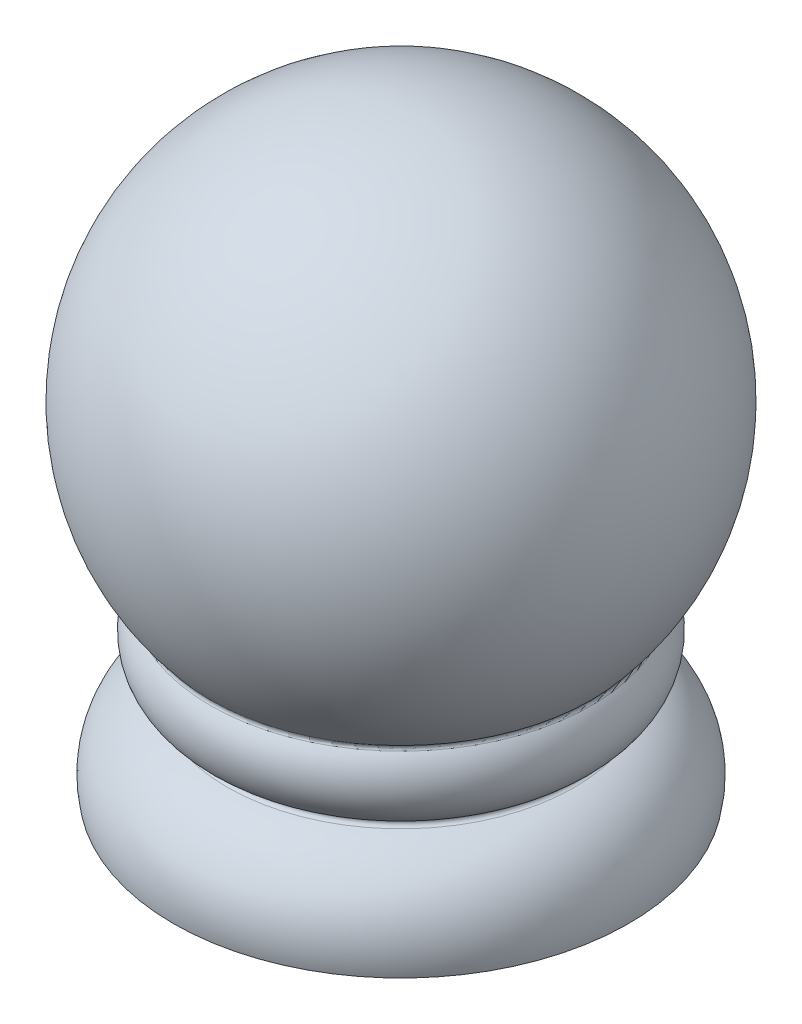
ISO-10303-21;
HEADER;
FILE_DESCRIPTION(('STEP AP214'),'2;1');
FILE_NAME('part.step','',(''),(''),'','','');
FILE_SCHEMA(('AUTOMOTIVE_DESIGN { 1 0 10303 214 1 1 1 1 }'));
ENDSEC;
DATA;
#1=APPLICATION_CONTEXT('core data for automotive mechanical design processes');
#2=APPLICATION_PROTOCOL_DEFINITION('international standard','automotive_design',2000,#1);
#3=PRODUCT_CONTEXT('',#1,'mechanical');
#4=PRODUCT('Part','Part','',(#3));
#5=PRODUCT_RELATED_PRODUCT_CATEGORY('part','',(#4));
#6=PRODUCT_DEFINITION_FORMATION('','',#4);
#7=PRODUCT_DEFINITION_CONTEXT('part definition',#1,'design');
#8=PRODUCT_DEFINITION('design','',#6,#7);
#9=PRODUCT_DEFINITION_SHAPE('','',#8);
#10=(LENGTH_UNIT() NAMED_UNIT(*) SI_UNIT(.MILLI.,.METRE.));
#11=(NAMED_UNIT(*) PLANE_ANGLE_UNIT() SI_UNIT($,.RADIAN.));
#12=(NAMED_UNIT(*) SI_UNIT($,.STERADIAN.) SOLID_ANGLE_UNIT());
#13=UNCERTAINTY_MEASURE_WITH_UNIT(LENGTH_MEASURE(1.E-05),#10,'distance_accuracy_value','');
#14=(GEOMETRIC_REPRESENTATION_CONTEXT(3) GLOBAL_UNCERTAINTY_ASSIGNED_CONTEXT((#13)) GLOBAL_UNIT_ASSIGNED_CONTEXT((#10,
#11,#12)) REPRESENTATION_CONTEXT('',''));
#15=CARTESIAN_POINT('',(0.,0.,0.));
#16=DIRECTION('',(0.,0.,1.));
#17=DIRECTION('',(1.,0.,0.));
#18=AXIS2_PLACEMENT_3D('',#15,#16,#17);
#19=CARTESIAN_POINT('',(10.,30.,0.));
#20=DIRECTION('',(0.,-1.,0.));
#21=DIRECTION('',(0.,0.,-1.));
#22=AXIS2_PLACEMENT_3D('',#19,#20,#21);
#23=PLANE('',#22);
#24=CARTESIAN_POINT('',(0.,30.,0.));
#25=DIRECTION('',(0.,-1.,0.));
#26=DIRECTION('',(0.,0.,-1.));
#27=AXIS2_PLACEMENT_3D('',#24,#25,#26);
#28=CIRCLE('',#27,8.);
#29=CARTESIAN_POINT('',(0.,30.,-8.));
#30=VERTEX_POINT('',#29);
#31=EDGE_CURVE('E10',#30,#30,#28,.T.);
#32=ORIENTED_EDGE('',*,*,#31,.T.);
#33=EDGE_LOOP('',(#32));
#34=FACE_BOUND('',#33,.T.);
#35=CARTESIAN_POINT('',(0.,30.,0.));
#36=DIRECTION('',(0.,-1.,0.));
#37=DIRECTION('',(0.,0.,-1.));
#38=AXIS2_PLACEMENT_3D('',#35,#36,#37);
#39=CIRCLE('',#38,4.5);
#40=CARTESIAN_POINT('',(0.,30.,-4.5));
#41=VERTEX_POINT('',#40);
#42=EDGE_CURVE('E80',#41,#41,#39,.T.);
#43=ORIENTED_EDGE('',*,*,#42,.F.);
#44=EDGE_LOOP('',(#43));
#45=FACE_BOUND('',#44,.T.);
#46=ADVANCED_FACE('F30',(#34,#45),#23,.T.);
#47=CARTESIAN_POINT('',(0.,0.,0.));
#48=DIRECTION('',(0.,1.,0.));
#49=DIRECTION('',(0.,0.,1.));
#50=AXIS2_PLACEMENT_3D('',#47,#48,#49);
#51=PLANE('',#50);
#52=CARTESIAN_POINT('',(0.,0.,0.));
#53=DIRECTION('',(0.,1.,0.));
#54=DIRECTION('',(0.,0.,1.));
#55=AXIS2_PLACEMENT_3D('',#52,#53,#54);
#56=CIRCLE('',#55,14.5);
#57=CARTESIAN_POINT('',(0.,0.,14.5));
#58=VERTEX_POINT('',#57);
#59=EDGE_CURVE('E56',#58,#58,#56,.T.);
#60=ORIENTED_EDGE('',*,*,#59,.F.);
#61=EDGE_LOOP('',(#60));
#62=FACE_BOUND('',#61,.T.);
#63=CARTESIAN_POINT('',(0.,0.,0.));
#64=DIRECTION('',(0.,1.,0.));
#65=DIRECTION('',(0.,0.,1.));
#66=AXIS2_PLACEMENT_3D('',#63,#64,#65);
#67=CIRCLE('',#66,13.5);
#68=CARTESIAN_POINT('',(0.,0.,13.5));
#69=VERTEX_POINT('',#68);
#70=EDGE_CURVE('E57',#69,#69,#67,.F.);
#71=ORIENTED_EDGE('',*,*,#70,.F.);
#72=EDGE_LOOP('',(#71));
#73=FACE_BOUND('',#72,.T.);
#74=ADVANCED_FACE('F32',(#62,#73),#51,.F.);
#75=CARTESIAN_POINT('',(0.,1.01568651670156,0.));
#76=DIRECTION('',(0.,1.,0.));
#77=DIRECTION('',(0.,0.,1.));
#78=AXIS2_PLACEMENT_3D('',#75,#76,#77);
#79=TOROIDAL_SURFACE('',#78,9.60424868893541,5.);
#80=CARTESIAN_POINT('',(0.,5.79974780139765,0.));
#81=DIRECTION('',(0.,1.,0.));
#82=DIRECTION('',(0.,0.,1.));
#83=AXIS2_PLACEMENT_3D('',#80,#81,#82);
#84=CIRCLE('',#83,11.0577814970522);
#85=CARTESIAN_POINT('',(0.,5.79974780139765,11.0577814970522));
#86=VERTEX_POINT('',#85);
#87=EDGE_CURVE('E64',#86,#86,#84,.T.);
#88=ORIENTED_EDGE('',*,*,#87,.F.);
#89=EDGE_LOOP('',(#88));
#90=FACE_BOUND('',#89,.T.);
#91=ORIENTED_EDGE('',*,*,#59,.T.);
#92=EDGE_LOOP('',(#91));
#93=FACE_BOUND('',#92,.T.);
#94=ADVANCED_FACE('F112',(#90,#93),#79,.T.);
#95=CARTESIAN_POINT('',(0.,6.03895086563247,0.));
#96=DIRECTION('',(0.,1.,0.));
#97=DIRECTION('',(0.,0.,1.));
#98=AXIS2_PLACEMENT_3D('',#95,#96,#97);
#99=TOROIDAL_SURFACE('',#98,11.130458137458,0.250000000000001);
#100=ORIENTED_EDGE('',*,*,#87,.T.);
#101=EDGE_LOOP('',(#100));
#102=FACE_BOUND('',#101,.T.);
#103=CARTESIAN_POINT('',(0.,6.2660549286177,0.));
#104=DIRECTION('',(0.,1.,0.));
#105=DIRECTION('',(0.,0.,1.));
#106=AXIS2_PLACEMENT_3D('',#103,#104,#105);
#107=CIRCLE('',#106,11.0259414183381);
#108=CARTESIAN_POINT('',(0.,6.2660549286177,11.0259414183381));
#109=VERTEX_POINT('',#108);
#110=EDGE_CURVE('E67',#109,#109,#107,.T.);
#111=ORIENTED_EDGE('',*,*,#110,.F.);
#112=EDGE_LOOP('',(#111));
#113=FACE_BOUND('',#112,.T.);
#114=ADVANCED_FACE('F141',(#102,#113),#99,.F.);
#115=CARTESIAN_POINT('',(0.,8.99130368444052,0.));
#116=DIRECTION('',(0.,1.,0.));
#117=DIRECTION('',(0.,0.,1.));
#118=AXIS2_PLACEMENT_3D('',#115,#116,#117);
#119=TOROIDAL_SURFACE('',#118,9.7717407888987,3.);
#120=CARTESIAN_POINT('',(0.,10.8428470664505,0.));
#121=DIRECTION('',(0.,1.,0.));
#122=DIRECTION('',(0.,0.,1.));
#123=AXIS2_PLACEMENT_3D('',#120,#121,#122);
#124=CIRCLE('',#123,12.1322041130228);
#125=CARTESIAN_POINT('',(0.,10.8428470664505,12.1322041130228));
#126=VERTEX_POINT('',#125);
#127=EDGE_CURVE('E70',#126,#126,#124,.T.);
#128=ORIENTED_EDGE('',*,*,#127,.F.);
#129=EDGE_LOOP('',(#128));
#130=FACE_BOUND('',#129,.T.);
#131=ORIENTED_EDGE('',*,*,#110,.T.);
#132=EDGE_LOOP('',(#131));
#133=FACE_BOUND('',#132,.T.);
#134=ADVANCED_FACE('F137',(#130,#133),#119,.T.);
#135=CARTESIAN_POINT('',(0.,10.9971423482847,0.));
#136=DIRECTION('',(0.,1.,0.));
#137=DIRECTION('',(0.,0.,1.));
#138=AXIS2_PLACEMENT_3D('',#135,#136,#137);
#139=TOROIDAL_SURFACE('',#138,12.3289093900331,0.249999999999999);
#140=ORIENTED_EDGE('',*,*,#127,.T.);
#141=EDGE_LOOP('',(#140));
#142=FACE_BOUND('',#141,.T.);
#143=CARTESIAN_POINT('',(0.,11.1600017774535,0.));
#144=DIRECTION('',(0.,1.,0.));
#145=DIRECTION('',(0.,0.,1.));
#146=AXIS2_PLACEMENT_3D('',#143,#144,#145);
#147=CIRCLE('',#146,12.1392338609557);
#148=CARTESIAN_POINT('',(0.,11.1600017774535,12.1392338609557));
#149=VERTEX_POINT('',#148);
#150=EDGE_CURVE('E60',#149,#149,#147,.T.);
#151=ORIENTED_EDGE('',*,*,#150,.F.);
#152=EDGE_LOOP('',(#151));
#153=FACE_BOUND('',#152,.T.);
#154=ADVANCED_FACE('F133',(#142,#153),#139,.F.);
#155=CARTESIAN_POINT('',(0.,21.5830052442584,0.));
#156=DIRECTION('',(0.,1.,0.));
#157=DIRECTION('',(1.,0.,0.));
#158=AXIS2_PLACEMENT_3D('',#155,#156,#157);
#159=SPHERICAL_SURFACE('',#158,16.);
#160=ORIENTED_EDGE('',*,*,#150,.T.);
#161=EDGE_LOOP('',(#160));
#162=FACE_BOUND('',#161,.T.);
#163=ADVANCED_FACE('F129',(#162),#159,.T.);
#164=CARTESIAN_POINT('',(0.,39.3418180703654,0.));
#165=DIRECTION('',(0.,1.,0.));
#166=DIRECTION('',(0.,0.,1.));
#167=AXIS2_PLACEMENT_3D('',#164,#165,#166);
#168=CYLINDRICAL_SURFACE('',#167,13.5);
#169=CARTESIAN_POINT('',(0.,2.,0.));
#170=DIRECTION('',(0.,1.,0.));
#171=DIRECTION('',(0.,0.,1.));
#172=AXIS2_PLACEMENT_3D('',#169,#170,#171);
#173=CIRCLE('',#172,13.5);
#174=CARTESIAN_POINT('',(0.,2.,13.5));
#175=VERTEX_POINT('',#174);
#176=EDGE_CURVE('E61',#175,#175,#173,.T.);
#177=ORIENTED_EDGE('',*,*,#176,.T.);
#178=EDGE_LOOP('',(#177));
#179=FACE_BOUND('',#178,.T.);
#180=ORIENTED_EDGE('',*,*,#70,.T.);
#181=EDGE_LOOP('',(#180));
#182=FACE_BOUND('',#181,.T.);
#183=ADVANCED_FACE('F125',(#179,#182),#168,.F.);
#184=CARTESIAN_POINT('',(13.5,2.,0.));
#185=DIRECTION('',(0.,-1.,0.));
#186=DIRECTION('',(0.,0.,-1.));
#187=AXIS2_PLACEMENT_3D('',#184,#185,#186);
#188=PLANE('',#187);
#189=CARTESIAN_POINT('',(0.,2.,0.));
#190=DIRECTION('',(0.,-1.,0.));
#191=DIRECTION('',(0.,0.,-1.));
#192=AXIS2_PLACEMENT_3D('',#189,#190,#191);
#193=CIRCLE('',#192,12.6385619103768);
#194=CARTESIAN_POINT('',(0.,2.,-12.6385619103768));
#195=VERTEX_POINT('',#194);
#196=EDGE_CURVE('E53',#195,#195,#193,.F.);
#197=ORIENTED_EDGE('',*,*,#196,.T.);
#198=EDGE_LOOP('',(#197));
#199=FACE_BOUND('',#198,.T.);
#200=ORIENTED_EDGE('',*,*,#176,.F.);
#201=EDGE_LOOP('',(#200));
#202=FACE_BOUND('',#201,.T.);
#203=ADVANCED_FACE('F121',(#199,#202),#188,.T.);
#204=CARTESIAN_POINT('',(0.,2.,0.));
#205=DIRECTION('',(0.,-1.,0.));
#206=DIRECTION('',(0.,0.,-1.));
#207=AXIS2_PLACEMENT_3D('',#204,#205,#206);
#208=CONICAL_SURFACE('',#207,12.5,0.558599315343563);
#209=CARTESIAN_POINT('',(0.,2.1175002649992,0.));
#210=DIRECTION('',(0.,1.,0.));
#211=DIRECTION('',(0.,0.,1.));
#212=AXIS2_PLACEMENT_3D('',#209,#210,#211);
#213=CIRCLE('',#212,12.4265623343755);
#214=CARTESIAN_POINT('',(0.,2.1175002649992,12.4265623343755));
#215=VERTEX_POINT('',#214);
#216=EDGE_CURVE('E50',#215,#215,#213,.F.);
#217=ORIENTED_EDGE('',*,*,#216,.T.);
#218=EDGE_LOOP('',(#217));
#219=FACE_BOUND('',#218,.T.);
#220=CARTESIAN_POINT('',(0.,6.,0.));
#221=DIRECTION('',(0.,1.,0.));
#222=DIRECTION('',(0.,0.,1.));
#223=AXIS2_PLACEMENT_3D('',#220,#221,#222);
#224=CIRCLE('',#223,10.);
#225=CARTESIAN_POINT('',(0.,6.,10.));
#226=VERTEX_POINT('',#225);
#227=EDGE_CURVE('E77',#226,#226,#224,.T.);
#228=ORIENTED_EDGE('',*,*,#227,.T.);
#229=EDGE_LOOP('',(#228));
#230=FACE_BOUND('',#229,.T.);
#231=ADVANCED_FACE('F118',(#219,#230),#208,.F.);
#232=CARTESIAN_POINT('',(0.,39.3418180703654,0.));
#233=DIRECTION('',(0.,1.,0.));
#234=DIRECTION('',(0.,0.,1.));
#235=AXIS2_PLACEMENT_3D('',#232,#233,#234);
#236=CYLINDRICAL_SURFACE('',#235,10.);
#237=CARTESIAN_POINT('',(0.,28.,0.));
#238=DIRECTION('',(0.,-1.,0.));
#239=DIRECTION('',(0.,0.,-1.));
#240=AXIS2_PLACEMENT_3D('',#237,#238,#239);
#241=CIRCLE('',#240,10.);
#242=CARTESIAN_POINT('',(0.,28.,-10.));
#243=VERTEX_POINT('',#242);
#244=EDGE_CURVE('E37',#243,#243,#241,.F.);
#245=ORIENTED_EDGE('',*,*,#244,.T.);
#246=EDGE_LOOP('',(#245));
#247=FACE_BOUND('',#246,.T.);
#248=ORIENTED_EDGE('',*,*,#227,.F.);
#249=EDGE_LOOP('',(#248));
#250=FACE_BOUND('',#249,.T.);
#251=ADVANCED_FACE('F104',(#247,#250),#236,.F.);
#252=CARTESIAN_POINT('',(0.,30.,0.));
#253=DIRECTION('',(0.,1.,0.));
#254=DIRECTION('',(0.,0.,-1.));
#255=AXIS2_PLACEMENT_3D('',#252,#253,#254);
#256=CONICAL_SURFACE('',#255,4.5,0.0174532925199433);
#257=CARTESIAN_POINT('',(0.,24.2456368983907,0.));
#258=DIRECTION('',(0.,1.,0.));
#259=DIRECTION('',(0.,0.,1.));
#260=AXIS2_PLACEMENT_3D('',#257,#258,#259);
#261=CIRCLE('',#260,4.39955721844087);
#262=CARTESIAN_POINT('',(0.,24.2456368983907,4.39955721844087));
#263=VERTEX_POINT('',#262);
#264=EDGE_CURVE('E41',#263,#263,#261,.T.);
#265=ORIENTED_EDGE('',*,*,#264,.T.);
#266=EDGE_LOOP('',(#265));
#267=FACE_BOUND('',#266,.T.);
#268=ORIENTED_EDGE('',*,*,#42,.T.);
#269=EDGE_LOOP('',(#268));
#270=FACE_BOUND('',#269,.T.);
#271=ADVANCED_FACE('F94',(#267,#270),#256,.T.);
#272=CARTESIAN_POINT('',(0.,24.,0.));
#273=DIRECTION('',(0.,-1.,0.));
#274=DIRECTION('',(0.,0.,-1.));
#275=AXIS2_PLACEMENT_3D('',#272,#273,#274);
#276=PLANE('',#275);
#277=CARTESIAN_POINT('',(0.,24.,0.));
#278=DIRECTION('',(0.,-1.,0.));
#279=DIRECTION('',(0.,0.,-1.));
#280=AXIS2_PLACEMENT_3D('',#277,#278,#279);
#281=CIRCLE('',#280,4.14959529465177);
#282=CARTESIAN_POINT('',(0.,24.,-4.14959529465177));
#283=VERTEX_POINT('',#282);
#284=EDGE_CURVE('E45',#283,#283,#281,.T.);
#285=ORIENTED_EDGE('',*,*,#284,.T.);
#286=EDGE_LOOP('',(#285));
#287=FACE_BOUND('',#286,.T.);
#288=CARTESIAN_POINT('',(0.,24.,0.));
#289=DIRECTION('',(0.,-1.,0.));
#290=DIRECTION('',(0.,0.,-1.));
#291=AXIS2_PLACEMENT_3D('',#288,#289,#290);
#292=CIRCLE('',#291,3.25);
#293=CARTESIAN_POINT('',(0.,24.,-3.25));
#294=VERTEX_POINT('',#293);
#295=EDGE_CURVE('E86',#294,#294,#292,.T.);
#296=ORIENTED_EDGE('',*,*,#295,.F.);
#297=EDGE_LOOP('',(#296));
#298=FACE_BOUND('',#297,.T.);
#299=ADVANCED_FACE('F92',(#287,#298),#276,.T.);
#300=CARTESIAN_POINT('',(0.,34.,0.));
#301=DIRECTION('',(0.,-1.,0.));
#302=DIRECTION('',(0.,0.,-1.));
#303=AXIS2_PLACEMENT_3D('',#300,#301,#302);
#304=CYLINDRICAL_SURFACE('',#303,3.25);
#305=CARTESIAN_POINT('',(0.,34.,0.));
#306=DIRECTION('',(0.,-1.,0.));
#307=DIRECTION('',(0.,0.,-1.));
#308=AXIS2_PLACEMENT_3D('',#305,#306,#307);
#309=CIRCLE('',#308,3.25);
#310=CARTESIAN_POINT('',(0.,34.,-3.25));
#311=VERTEX_POINT('',#310);
#312=EDGE_CURVE('E83',#311,#311,#309,.T.);
#313=ORIENTED_EDGE('',*,*,#312,.F.);
#314=EDGE_LOOP('',(#313));
#315=FACE_BOUND('',#314,.T.);
#316=ORIENTED_EDGE('',*,*,#295,.T.);
#317=EDGE_LOOP('',(#316));
#318=FACE_BOUND('',#317,.T.);
#319=ADVANCED_FACE('F90',(#315,#318),#304,.F.);
#320=CARTESIAN_POINT('',(0.,34.,0.));
#321=DIRECTION('',(0.,-1.,0.));
#322=DIRECTION('',(0.,0.,-1.));
#323=AXIS2_PLACEMENT_3D('',#320,#321,#322);
#324=PLANE('',#323);
#325=ORIENTED_EDGE('',*,*,#312,.T.);
#326=EDGE_LOOP('',(#325));
#327=FACE_BOUND('',#326,.T.);
#328=ADVANCED_FACE('F101',(#327),#324,.T.);
#329=CARTESIAN_POINT('',(0.,2.25,0.));
#330=DIRECTION('',(0.,-1.,0.));
#331=DIRECTION('',(0.,0.,-1.));
#332=AXIS2_PLACEMENT_3D('',#329,#330,#331);
#333=TOROIDAL_SURFACE('',#332,12.6385619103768,0.25);
#334=ORIENTED_EDGE('',*,*,#216,.F.);
#335=EDGE_LOOP('',(#334));
#336=FACE_BOUND('',#335,.T.);
#337=ORIENTED_EDGE('',*,*,#196,.F.);
#338=EDGE_LOOP('',(#337));
#339=FACE_BOUND('',#338,.T.);
#340=ADVANCED_FACE('F210',(#336,#339),#333,.T.);
#341=CARTESIAN_POINT('',(0.,24.25,0.));
#342=DIRECTION('',(0.,-1.,0.));
#343=DIRECTION('',(0.,0.,-1.));
#344=AXIS2_PLACEMENT_3D('',#341,#342,#343);
#345=TOROIDAL_SURFACE('',#344,4.14959529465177,0.25);
#346=ORIENTED_EDGE('',*,*,#264,.F.);
#347=EDGE_LOOP('',(#346));
#348=FACE_BOUND('',#347,.T.);
#349=ORIENTED_EDGE('',*,*,#284,.F.);
#350=EDGE_LOOP('',(#349));
#351=FACE_BOUND('',#350,.T.);
#352=ADVANCED_FACE('F215',(#348,#351),#345,.T.);
#353=CARTESIAN_POINT('',(0.,28.,0.));
#354=DIRECTION('',(0.,-1.,0.));
#355=DIRECTION('',(0.,0.,-1.));
#356=AXIS2_PLACEMENT_3D('',#353,#354,#355);
#357=TOROIDAL_SURFACE('',#356,8.,2.);
#358=ORIENTED_EDGE('',*,*,#31,.F.);
#359=EDGE_LOOP('',(#358));
#360=FACE_BOUND('',#359,.T.);
#361=ORIENTED_EDGE('',*,*,#244,.F.);
#362=EDGE_LOOP('',(#361));
#363=FACE_BOUND('',#362,.T.);
#364=ADVANCED_FACE('F226',(#360,#363),#357,.F.);
#365=CLOSED_SHELL('',(#46,#74,#94,#114,#134,#154,#163,#183,#203,#231,#251,#271,#299,#319,#328,
#340,#352,#364));
#366=MANIFOLD_SOLID_BREP('B2',#365);
#367=ADVANCED_BREP_SHAPE_REPRESENTATION('',(#18,#366),#14);
#368=SHAPE_DEFINITION_REPRESENTATION(#9,#367);
ENDSEC;
END-ISO-10303-21;
